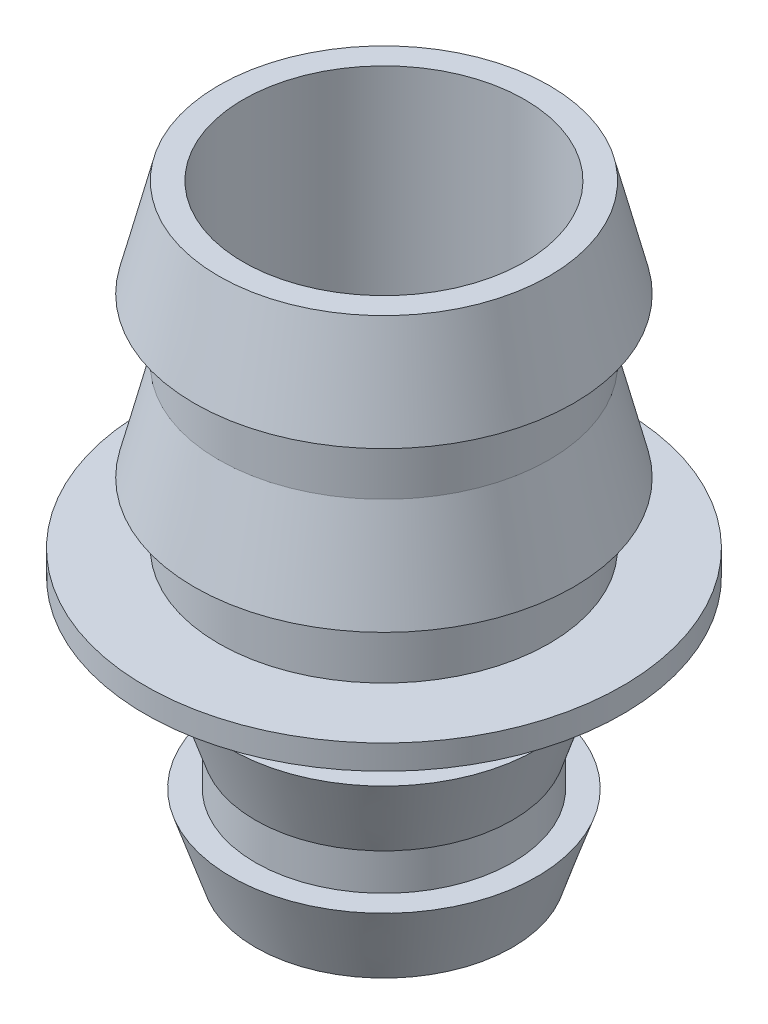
ISO-10303-21;
HEADER;
FILE_DESCRIPTION(('STEP AP214'),'2;1');
FILE_NAME('part.step','',(''),(''),'','','');
FILE_SCHEMA(('AUTOMOTIVE_DESIGN { 1 0 10303 214 1 1 1 1 }'));
ENDSEC;
DATA;
#1=APPLICATION_CONTEXT('core data for automotive mechanical design processes');
#2=APPLICATION_PROTOCOL_DEFINITION('international standard','automotive_design',2000,#1);
#3=PRODUCT_CONTEXT('',#1,'mechanical');
#4=PRODUCT('Part','Part','',(#3));
#5=PRODUCT_RELATED_PRODUCT_CATEGORY('part','',(#4));
#6=PRODUCT_DEFINITION_FORMATION('','',#4);
#7=PRODUCT_DEFINITION_CONTEXT('part definition',#1,'design');
#8=PRODUCT_DEFINITION('design','',#6,#7);
#9=PRODUCT_DEFINITION_SHAPE('','',#8);
#10=(LENGTH_UNIT() NAMED_UNIT(*) SI_UNIT(.MILLI.,.METRE.));
#11=(NAMED_UNIT(*) PLANE_ANGLE_UNIT() SI_UNIT($,.RADIAN.));
#12=(NAMED_UNIT(*) SI_UNIT($,.STERADIAN.) SOLID_ANGLE_UNIT());
#13=UNCERTAINTY_MEASURE_WITH_UNIT(LENGTH_MEASURE(1.E-05),#10,'distance_accuracy_value','');
#14=(GEOMETRIC_REPRESENTATION_CONTEXT(3) GLOBAL_UNCERTAINTY_ASSIGNED_CONTEXT((#13)) GLOBAL_UNIT_ASSIGNED_CONTEXT((#10,
#11,#12)) REPRESENTATION_CONTEXT('',''));
#15=CARTESIAN_POINT('',(0.,0.,0.));
#16=DIRECTION('',(0.,0.,1.));
#17=DIRECTION('',(1.,0.,0.));
#18=AXIS2_PLACEMENT_3D('',#15,#16,#17);
#19=CARTESIAN_POINT('',(-6.75,10.5,0.));
#20=DIRECTION('',(0.,-1.,0.));
#21=DIRECTION('',(0.,0.,-1.));
#22=AXIS2_PLACEMENT_3D('',#19,#20,#21);
#23=PLANE('',#22);
#24=CARTESIAN_POINT('',(0.,10.5,0.));
#25=DIRECTION('',(0.,-1.,0.));
#26=DIRECTION('',(0.,0.,-1.));
#27=AXIS2_PLACEMENT_3D('',#24,#25,#26);
#28=CIRCLE('',#27,6.75);
#29=CARTESIAN_POINT('',(0.,10.5,-6.75));
#30=VERTEX_POINT('',#29);
#31=EDGE_CURVE('E124',#30,#30,#28,.T.);
#32=ORIENTED_EDGE('',*,*,#31,.F.);
#33=EDGE_LOOP('',(#32));
#34=FACE_BOUND('',#33,.T.);
#35=CARTESIAN_POINT('',(0.,10.5,0.));
#36=DIRECTION('',(0.,-1.,0.));
#37=DIRECTION('',(0.,0.,-1.));
#38=AXIS2_PLACEMENT_3D('',#35,#36,#37);
#39=CIRCLE('',#38,5.75);
#40=CARTESIAN_POINT('',(0.,10.5,-5.75));
#41=VERTEX_POINT('',#40);
#42=EDGE_CURVE('E10',#41,#41,#39,.T.);
#43=ORIENTED_EDGE('',*,*,#42,.T.);
#44=EDGE_LOOP('',(#43));
#45=FACE_BOUND('',#44,.T.);
#46=ADVANCED_FACE('F37',(#34,#45),#23,.F.);
#47=CARTESIAN_POINT('',(0.,0.,0.));
#48=DIRECTION('',(0.,-1.,0.));
#49=DIRECTION('',(0.,0.,-1.));
#50=AXIS2_PLACEMENT_3D('',#47,#48,#49);
#51=CYLINDRICAL_SURFACE('',#50,5.75);
#52=ORIENTED_EDGE('',*,*,#42,.F.);
#53=EDGE_LOOP('',(#52));
#54=FACE_BOUND('',#53,.T.);
#55=CARTESIAN_POINT('',(0.,-2.5,0.));
#56=DIRECTION('',(0.,-1.,0.));
#57=DIRECTION('',(0.,0.,-1.));
#58=AXIS2_PLACEMENT_3D('',#55,#56,#57);
#59=CIRCLE('',#58,5.75);
#60=CARTESIAN_POINT('',(0.,-2.5,-5.75));
#61=VERTEX_POINT('',#60);
#62=EDGE_CURVE('E44',#61,#61,#59,.T.);
#63=ORIENTED_EDGE('',*,*,#62,.T.);
#64=EDGE_LOOP('',(#63));
#65=FACE_BOUND('',#64,.T.);
#66=ADVANCED_FACE('F132',(#54,#65),#51,.F.);
#67=CARTESIAN_POINT('',(0.,-3.5,0.));
#68=DIRECTION('',(0.,1.,0.));
#69=DIRECTION('',(0.,0.,1.));
#70=AXIS2_PLACEMENT_3D('',#67,#68,#69);
#71=CONICAL_SURFACE('',#70,4.25,0.982793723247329);
#72=ORIENTED_EDGE('',*,*,#62,.F.);
#73=EDGE_LOOP('',(#72));
#74=FACE_BOUND('',#73,.T.);
#75=CARTESIAN_POINT('',(0.,-3.5,0.));
#76=DIRECTION('',(0.,-1.,0.));
#77=DIRECTION('',(0.,0.,-1.));
#78=AXIS2_PLACEMENT_3D('',#75,#76,#77);
#79=CIRCLE('',#78,4.25);
#80=CARTESIAN_POINT('',(0.,-3.5,-4.25));
#81=VERTEX_POINT('',#80);
#82=EDGE_CURVE('E49',#81,#81,#79,.T.);
#83=ORIENTED_EDGE('',*,*,#82,.T.);
#84=EDGE_LOOP('',(#83));
#85=FACE_BOUND('',#84,.T.);
#86=ADVANCED_FACE('F136',(#74,#85),#71,.F.);
#87=CARTESIAN_POINT('',(0.,0.,0.));
#88=DIRECTION('',(0.,-1.,0.));
#89=DIRECTION('',(0.,0.,-1.));
#90=AXIS2_PLACEMENT_3D('',#87,#88,#89);
#91=CYLINDRICAL_SURFACE('',#90,4.25);
#92=ORIENTED_EDGE('',*,*,#82,.F.);
#93=EDGE_LOOP('',(#92));
#94=FACE_BOUND('',#93,.T.);
#95=CARTESIAN_POINT('',(0.,-14.,0.));
#96=DIRECTION('',(0.,-1.,0.));
#97=DIRECTION('',(0.,0.,-1.));
#98=AXIS2_PLACEMENT_3D('',#95,#96,#97);
#99=CIRCLE('',#98,4.25);
#100=CARTESIAN_POINT('',(0.,-14.,-4.25));
#101=VERTEX_POINT('',#100);
#102=EDGE_CURVE('E54',#101,#101,#99,.T.);
#103=ORIENTED_EDGE('',*,*,#102,.T.);
#104=EDGE_LOOP('',(#103));
#105=FACE_BOUND('',#104,.T.);
#106=ADVANCED_FACE('F141',(#94,#105),#91,.F.);
#107=CARTESIAN_POINT('',(-5.25,-14.,0.));
#108=DIRECTION('',(0.,1.,0.));
#109=DIRECTION('',(0.,0.,1.));
#110=AXIS2_PLACEMENT_3D('',#107,#108,#109);
#111=PLANE('',#110);
#112=ORIENTED_EDGE('',*,*,#102,.F.);
#113=EDGE_LOOP('',(#112));
#114=FACE_BOUND('',#113,.T.);
#115=CARTESIAN_POINT('',(0.,-14.,0.));
#116=DIRECTION('',(0.,-1.,0.));
#117=DIRECTION('',(0.,0.,-1.));
#118=AXIS2_PLACEMENT_3D('',#115,#116,#117);
#119=CIRCLE('',#118,5.25);
#120=CARTESIAN_POINT('',(0.,-14.,-5.25));
#121=VERTEX_POINT('',#120);
#122=EDGE_CURVE('E60',#121,#121,#119,.T.);
#123=ORIENTED_EDGE('',*,*,#122,.T.);
#124=EDGE_LOOP('',(#123));
#125=FACE_BOUND('',#124,.T.);
#126=ADVANCED_FACE('F147',(#114,#125),#111,.F.);
#127=CARTESIAN_POINT('',(0.,-11.,0.));
#128=DIRECTION('',(0.,1.,0.));
#129=DIRECTION('',(0.,0.,1.));
#130=AXIS2_PLACEMENT_3D('',#127,#128,#129);
#131=CONICAL_SURFACE('',#130,6.25,0.321750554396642);
#132=ORIENTED_EDGE('',*,*,#122,.F.);
#133=EDGE_LOOP('',(#132));
#134=FACE_BOUND('',#133,.T.);
#135=CARTESIAN_POINT('',(0.,-11.,0.));
#136=DIRECTION('',(0.,-1.,0.));
#137=DIRECTION('',(0.,0.,-1.));
#138=AXIS2_PLACEMENT_3D('',#135,#136,#137);
#139=CIRCLE('',#138,6.25);
#140=CARTESIAN_POINT('',(0.,-11.,-6.25));
#141=VERTEX_POINT('',#140);
#142=EDGE_CURVE('E64',#141,#141,#139,.T.);
#143=ORIENTED_EDGE('',*,*,#142,.T.);
#144=EDGE_LOOP('',(#143));
#145=FACE_BOUND('',#144,.T.);
#146=ADVANCED_FACE('F151',(#134,#145),#131,.T.);
#147=CARTESIAN_POINT('',(-5.25,-11.,0.));
#148=DIRECTION('',(0.,-1.,0.));
#149=DIRECTION('',(0.,0.,-1.));
#150=AXIS2_PLACEMENT_3D('',#147,#148,#149);
#151=PLANE('',#150);
#152=ORIENTED_EDGE('',*,*,#142,.F.);
#153=EDGE_LOOP('',(#152));
#154=FACE_BOUND('',#153,.T.);
#155=CARTESIAN_POINT('',(0.,-11.,0.));
#156=DIRECTION('',(0.,-1.,0.));
#157=DIRECTION('',(0.,0.,-1.));
#158=AXIS2_PLACEMENT_3D('',#155,#156,#157);
#159=CIRCLE('',#158,5.25);
#160=CARTESIAN_POINT('',(0.,-11.,-5.25));
#161=VERTEX_POINT('',#160);
#162=EDGE_CURVE('E68',#161,#161,#159,.T.);
#163=ORIENTED_EDGE('',*,*,#162,.T.);
#164=EDGE_LOOP('',(#163));
#165=FACE_BOUND('',#164,.T.);
#166=ADVANCED_FACE('F155',(#154,#165),#151,.F.);
#167=CARTESIAN_POINT('',(0.,0.,0.));
#168=DIRECTION('',(0.,-1.,0.));
#169=DIRECTION('',(0.,0.,-1.));
#170=AXIS2_PLACEMENT_3D('',#167,#168,#169);
#171=CYLINDRICAL_SURFACE('',#170,5.25);
#172=ORIENTED_EDGE('',*,*,#162,.F.);
#173=EDGE_LOOP('',(#172));
#174=FACE_BOUND('',#173,.T.);
#175=CARTESIAN_POINT('',(0.,-9.5,0.));
#176=DIRECTION('',(0.,-1.,0.));
#177=DIRECTION('',(0.,0.,-1.));
#178=AXIS2_PLACEMENT_3D('',#175,#176,#177);
#179=CIRCLE('',#178,5.25);
#180=CARTESIAN_POINT('',(0.,-9.5,-5.25));
#181=VERTEX_POINT('',#180);
#182=EDGE_CURVE('E72',#181,#181,#179,.T.);
#183=ORIENTED_EDGE('',*,*,#182,.T.);
#184=EDGE_LOOP('',(#183));
#185=FACE_BOUND('',#184,.T.);
#186=ADVANCED_FACE('F159',(#174,#185),#171,.T.);
#187=CARTESIAN_POINT('',(0.,-6.5,0.));
#188=DIRECTION('',(0.,1.,0.));
#189=DIRECTION('',(0.,0.,1.));
#190=AXIS2_PLACEMENT_3D('',#187,#188,#189);
#191=CONICAL_SURFACE('',#190,6.25,0.321750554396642);
#192=ORIENTED_EDGE('',*,*,#182,.F.);
#193=EDGE_LOOP('',(#192));
#194=FACE_BOUND('',#193,.T.);
#195=CARTESIAN_POINT('',(0.,-6.5,0.));
#196=DIRECTION('',(0.,-1.,0.));
#197=DIRECTION('',(0.,0.,-1.));
#198=AXIS2_PLACEMENT_3D('',#195,#196,#197);
#199=CIRCLE('',#198,6.25);
#200=CARTESIAN_POINT('',(0.,-6.5,-6.25));
#201=VERTEX_POINT('',#200);
#202=EDGE_CURVE('E76',#201,#201,#199,.T.);
#203=ORIENTED_EDGE('',*,*,#202,.T.);
#204=EDGE_LOOP('',(#203));
#205=FACE_BOUND('',#204,.T.);
#206=ADVANCED_FACE('F163',(#194,#205),#191,.T.);
#207=CARTESIAN_POINT('',(-5.25,-6.5,0.));
#208=DIRECTION('',(0.,-1.,0.));
#209=DIRECTION('',(0.,0.,-1.));
#210=AXIS2_PLACEMENT_3D('',#207,#208,#209);
#211=PLANE('',#210);
#212=ORIENTED_EDGE('',*,*,#202,.F.);
#213=EDGE_LOOP('',(#212));
#214=FACE_BOUND('',#213,.T.);
#215=CARTESIAN_POINT('',(0.,-6.5,0.));
#216=DIRECTION('',(0.,-1.,0.));
#217=DIRECTION('',(0.,0.,-1.));
#218=AXIS2_PLACEMENT_3D('',#215,#216,#217);
#219=CIRCLE('',#218,5.25);
#220=CARTESIAN_POINT('',(0.,-6.5,-5.25));
#221=VERTEX_POINT('',#220);
#222=EDGE_CURVE('E80',#221,#221,#219,.T.);
#223=ORIENTED_EDGE('',*,*,#222,.T.);
#224=EDGE_LOOP('',(#223));
#225=FACE_BOUND('',#224,.T.);
#226=ADVANCED_FACE('F167',(#214,#225),#211,.F.);
#227=CARTESIAN_POINT('',(0.,0.,0.));
#228=DIRECTION('',(0.,-1.,0.));
#229=DIRECTION('',(0.,0.,-1.));
#230=AXIS2_PLACEMENT_3D('',#227,#228,#229);
#231=CYLINDRICAL_SURFACE('',#230,5.25);
#232=ORIENTED_EDGE('',*,*,#222,.F.);
#233=EDGE_LOOP('',(#232));
#234=FACE_BOUND('',#233,.T.);
#235=CARTESIAN_POINT('',(0.,-4.5,0.));
#236=DIRECTION('',(0.,-1.,0.));
#237=DIRECTION('',(0.,0.,-1.));
#238=AXIS2_PLACEMENT_3D('',#235,#236,#237);
#239=CIRCLE('',#238,5.25);
#240=CARTESIAN_POINT('',(0.,-4.5,-5.25));
#241=VERTEX_POINT('',#240);
#242=EDGE_CURVE('E84',#241,#241,#239,.T.);
#243=ORIENTED_EDGE('',*,*,#242,.T.);
#244=EDGE_LOOP('',(#243));
#245=FACE_BOUND('',#244,.T.);
#246=ADVANCED_FACE('F171',(#234,#245),#231,.T.);
#247=CARTESIAN_POINT('',(0.,-3.5,0.));
#248=DIRECTION('',(0.,1.,0.));
#249=DIRECTION('',(0.,0.,1.));
#250=AXIS2_PLACEMENT_3D('',#247,#248,#249);
#251=CONICAL_SURFACE('',#250,6.75,0.982793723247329);
#252=ORIENTED_EDGE('',*,*,#242,.F.);
#253=EDGE_LOOP('',(#252));
#254=FACE_BOUND('',#253,.T.);
#255=CARTESIAN_POINT('',(0.,-3.5,0.));
#256=DIRECTION('',(0.,-1.,0.));
#257=DIRECTION('',(0.,0.,-1.));
#258=AXIS2_PLACEMENT_3D('',#255,#256,#257);
#259=CIRCLE('',#258,6.75);
#260=CARTESIAN_POINT('',(0.,-3.5,-6.75));
#261=VERTEX_POINT('',#260);
#262=EDGE_CURVE('E88',#261,#261,#259,.T.);
#263=ORIENTED_EDGE('',*,*,#262,.T.);
#264=EDGE_LOOP('',(#263));
#265=FACE_BOUND('',#264,.T.);
#266=ADVANCED_FACE('F175',(#254,#265),#251,.T.);
#267=CARTESIAN_POINT('',(-9.75,-3.5,0.));
#268=DIRECTION('',(0.,1.,0.));
#269=DIRECTION('',(0.,0.,1.));
#270=AXIS2_PLACEMENT_3D('',#267,#268,#269);
#271=PLANE('',#270);
#272=ORIENTED_EDGE('',*,*,#262,.F.);
#273=EDGE_LOOP('',(#272));
#274=FACE_BOUND('',#273,.T.);
#275=CARTESIAN_POINT('',(0.,-3.5,0.));
#276=DIRECTION('',(0.,-1.,0.));
#277=DIRECTION('',(0.,0.,-1.));
#278=AXIS2_PLACEMENT_3D('',#275,#276,#277);
#279=CIRCLE('',#278,9.75);
#280=CARTESIAN_POINT('',(0.,-3.5,-9.75));
#281=VERTEX_POINT('',#280);
#282=EDGE_CURVE('E92',#281,#281,#279,.T.);
#283=ORIENTED_EDGE('',*,*,#282,.T.);
#284=EDGE_LOOP('',(#283));
#285=FACE_BOUND('',#284,.T.);
#286=ADVANCED_FACE('F179',(#274,#285),#271,.F.);
#287=CARTESIAN_POINT('',(0.,0.,0.));
#288=DIRECTION('',(0.,-1.,0.));
#289=DIRECTION('',(0.,0.,-1.));
#290=AXIS2_PLACEMENT_3D('',#287,#288,#289);
#291=CYLINDRICAL_SURFACE('',#290,9.75);
#292=ORIENTED_EDGE('',*,*,#282,.F.);
#293=EDGE_LOOP('',(#292));
#294=FACE_BOUND('',#293,.T.);
#295=CARTESIAN_POINT('',(0.,-2.5,0.));
#296=DIRECTION('',(0.,-1.,0.));
#297=DIRECTION('',(0.,0.,-1.));
#298=AXIS2_PLACEMENT_3D('',#295,#296,#297);
#299=CIRCLE('',#298,9.75);
#300=CARTESIAN_POINT('',(0.,-2.5,-9.75));
#301=VERTEX_POINT('',#300);
#302=EDGE_CURVE('E96',#301,#301,#299,.T.);
#303=ORIENTED_EDGE('',*,*,#302,.T.);
#304=EDGE_LOOP('',(#303));
#305=FACE_BOUND('',#304,.T.);
#306=ADVANCED_FACE('F183',(#294,#305),#291,.T.);
#307=CARTESIAN_POINT('',(-6.75,-2.5,0.));
#308=DIRECTION('',(0.,-1.,0.));
#309=DIRECTION('',(0.,0.,-1.));
#310=AXIS2_PLACEMENT_3D('',#307,#308,#309);
#311=PLANE('',#310);
#312=ORIENTED_EDGE('',*,*,#302,.F.);
#313=EDGE_LOOP('',(#312));
#314=FACE_BOUND('',#313,.T.);
#315=CARTESIAN_POINT('',(0.,-2.5,0.));
#316=DIRECTION('',(0.,-1.,0.));
#317=DIRECTION('',(0.,0.,-1.));
#318=AXIS2_PLACEMENT_3D('',#315,#316,#317);
#319=CIRCLE('',#318,6.75);
#320=CARTESIAN_POINT('',(0.,-2.5,-6.75));
#321=VERTEX_POINT('',#320);
#322=EDGE_CURVE('E100',#321,#321,#319,.T.);
#323=ORIENTED_EDGE('',*,*,#322,.T.);
#324=EDGE_LOOP('',(#323));
#325=FACE_BOUND('',#324,.T.);
#326=ADVANCED_FACE('F187',(#314,#325),#311,.F.);
#327=CARTESIAN_POINT('',(0.,0.,0.));
#328=DIRECTION('',(0.,-1.,0.));
#329=DIRECTION('',(0.,0.,-1.));
#330=AXIS2_PLACEMENT_3D('',#327,#328,#329);
#331=CYLINDRICAL_SURFACE('',#330,6.75);
#332=ORIENTED_EDGE('',*,*,#322,.F.);
#333=EDGE_LOOP('',(#332));
#334=FACE_BOUND('',#333,.T.);
#335=CARTESIAN_POINT('',(0.,0.,0.));
#336=DIRECTION('',(0.,-1.,0.));
#337=DIRECTION('',(0.,0.,-1.));
#338=AXIS2_PLACEMENT_3D('',#335,#336,#337);
#339=CIRCLE('',#338,6.75);
#340=CARTESIAN_POINT('',(0.,0.,-6.75));
#341=VERTEX_POINT('',#340);
#342=EDGE_CURVE('E104',#341,#341,#339,.T.);
#343=ORIENTED_EDGE('',*,*,#342,.T.);
#344=EDGE_LOOP('',(#343));
#345=FACE_BOUND('',#344,.T.);
#346=ADVANCED_FACE('F191',(#334,#345),#331,.T.);
#347=CARTESIAN_POINT('',(-7.75,0.,0.));
#348=DIRECTION('',(0.,1.,0.));
#349=DIRECTION('',(0.,0.,1.));
#350=AXIS2_PLACEMENT_3D('',#347,#348,#349);
#351=PLANE('',#350);
#352=ORIENTED_EDGE('',*,*,#342,.F.);
#353=EDGE_LOOP('',(#352));
#354=FACE_BOUND('',#353,.T.);
#355=CARTESIAN_POINT('',(0.,0.,0.));
#356=DIRECTION('',(0.,-1.,0.));
#357=DIRECTION('',(0.,0.,-1.));
#358=AXIS2_PLACEMENT_3D('',#355,#356,#357);
#359=CIRCLE('',#358,7.75);
#360=CARTESIAN_POINT('',(0.,0.,-7.75));
#361=VERTEX_POINT('',#360);
#362=EDGE_CURVE('E108',#361,#361,#359,.T.);
#363=ORIENTED_EDGE('',*,*,#362,.T.);
#364=EDGE_LOOP('',(#363));
#365=FACE_BOUND('',#364,.T.);
#366=ADVANCED_FACE('F195',(#354,#365),#351,.F.);
#367=CARTESIAN_POINT('',(0.,4.,0.));
#368=DIRECTION('',(0.,-1.,0.));
#369=DIRECTION('',(0.,0.,-1.));
#370=AXIS2_PLACEMENT_3D('',#367,#368,#369);
#371=CONICAL_SURFACE('',#370,6.75,0.244978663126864);
#372=ORIENTED_EDGE('',*,*,#362,.F.);
#373=EDGE_LOOP('',(#372));
#374=FACE_BOUND('',#373,.T.);
#375=CARTESIAN_POINT('',(0.,4.,0.));
#376=DIRECTION('',(0.,-1.,0.));
#377=DIRECTION('',(0.,0.,-1.));
#378=AXIS2_PLACEMENT_3D('',#375,#376,#377);
#379=CIRCLE('',#378,6.75);
#380=CARTESIAN_POINT('',(0.,4.,-6.75));
#381=VERTEX_POINT('',#380);
#382=EDGE_CURVE('E112',#381,#381,#379,.T.);
#383=ORIENTED_EDGE('',*,*,#382,.T.);
#384=EDGE_LOOP('',(#383));
#385=FACE_BOUND('',#384,.T.);
#386=ADVANCED_FACE('F199',(#374,#385),#371,.T.);
#387=CARTESIAN_POINT('',(0.,0.,0.));
#388=DIRECTION('',(0.,-1.,0.));
#389=DIRECTION('',(0.,0.,-1.));
#390=AXIS2_PLACEMENT_3D('',#387,#388,#389);
#391=CYLINDRICAL_SURFACE('',#390,6.75);
#392=ORIENTED_EDGE('',*,*,#382,.F.);
#393=EDGE_LOOP('',(#392));
#394=FACE_BOUND('',#393,.T.);
#395=CARTESIAN_POINT('',(0.,6.5,0.));
#396=DIRECTION('',(0.,-1.,0.));
#397=DIRECTION('',(0.,0.,-1.));
#398=AXIS2_PLACEMENT_3D('',#395,#396,#397);
#399=CIRCLE('',#398,6.75);
#400=CARTESIAN_POINT('',(0.,6.5,-6.75));
#401=VERTEX_POINT('',#400);
#402=EDGE_CURVE('E116',#401,#401,#399,.T.);
#403=ORIENTED_EDGE('',*,*,#402,.T.);
#404=EDGE_LOOP('',(#403));
#405=FACE_BOUND('',#404,.T.);
#406=ADVANCED_FACE('F203',(#394,#405),#391,.T.);
#407=CARTESIAN_POINT('',(-7.75,6.5,0.));
#408=DIRECTION('',(0.,1.,0.));
#409=DIRECTION('',(0.,0.,1.));
#410=AXIS2_PLACEMENT_3D('',#407,#408,#409);
#411=PLANE('',#410);
#412=ORIENTED_EDGE('',*,*,#402,.F.);
#413=EDGE_LOOP('',(#412));
#414=FACE_BOUND('',#413,.T.);
#415=CARTESIAN_POINT('',(0.,6.5,0.));
#416=DIRECTION('',(0.,-1.,0.));
#417=DIRECTION('',(0.,0.,-1.));
#418=AXIS2_PLACEMENT_3D('',#415,#416,#417);
#419=CIRCLE('',#418,7.75);
#420=CARTESIAN_POINT('',(0.,6.5,-7.75));
#421=VERTEX_POINT('',#420);
#422=EDGE_CURVE('E120',#421,#421,#419,.T.);
#423=ORIENTED_EDGE('',*,*,#422,.T.);
#424=EDGE_LOOP('',(#423));
#425=FACE_BOUND('',#424,.T.);
#426=ADVANCED_FACE('F207',(#414,#425),#411,.F.);
#427=CARTESIAN_POINT('',(0.,10.5,0.));
#428=DIRECTION('',(0.,-1.,0.));
#429=DIRECTION('',(0.,0.,-1.));
#430=AXIS2_PLACEMENT_3D('',#427,#428,#429);
#431=CONICAL_SURFACE('',#430,6.75,0.244978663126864);
#432=ORIENTED_EDGE('',*,*,#422,.F.);
#433=EDGE_LOOP('',(#432));
#434=FACE_BOUND('',#433,.T.);
#435=ORIENTED_EDGE('',*,*,#31,.T.);
#436=EDGE_LOOP('',(#435));
#437=FACE_BOUND('',#436,.T.);
#438=ADVANCED_FACE('F129',(#434,#437),#431,.T.);
#439=CLOSED_SHELL('',(#46,#66,#86,#106,#126,#146,#166,#186,#206,#226,#246,#266,#286,#306,#326,
#346,#366,#386,#406,#426,#438));
#440=MANIFOLD_SOLID_BREP('B2',#439);
#441=ADVANCED_BREP_SHAPE_REPRESENTATION('',(#18,#440),#14);
#442=SHAPE_DEFINITION_REPRESENTATION(#9,#441);
ENDSEC;
END-ISO-10303-21;
